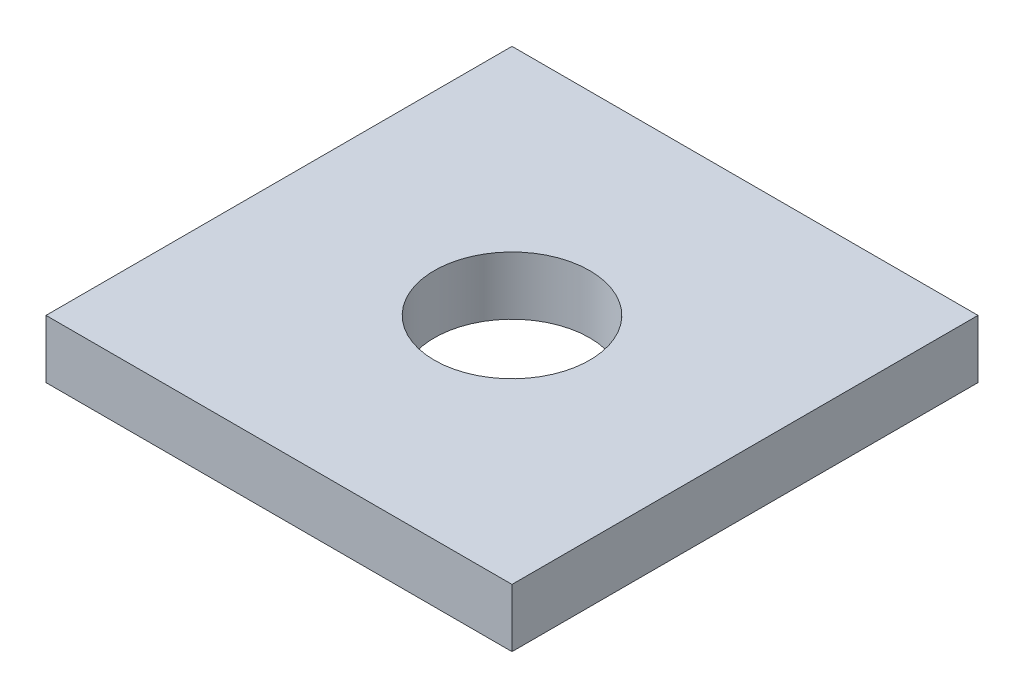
from build123d import *

# Parameters (mm, degrees)
SKETCH1_W           = 12
SKETCH1_H           = 12
SKETCH1_R           = 2
BOSS_EXTRUDE2_DEPTH = 1.5


with BuildPart() as part:
    # Sketch1 → Boss-Extrude2 (new body)
    with BuildSketch(Plane(origin=(0, 0, 0), x_dir=(1, 0, 0), z_dir=(0, 1, 0))):
        with Locations((6, 6)):
            Rectangle(SKETCH1_W, SKETCH1_H)
        with Locations(Location((6, 6, 0), (0, 0, 270))):
            Circle(SKETCH1_R, mode=Mode.SUBTRACT)
    extrude(amount=BOSS_EXTRUDE2_DEPTH)


solid = part.part
